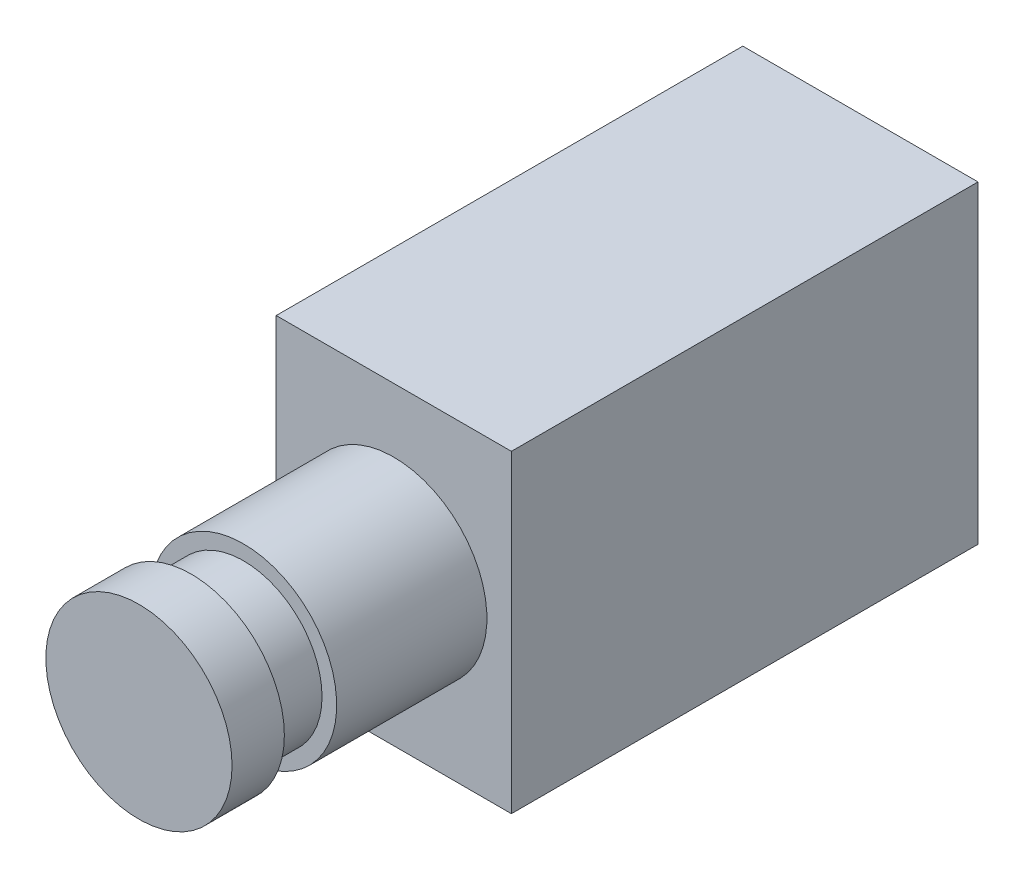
from build123d import *

# Parameters (mm, degrees)
SKETCH1_W           = 14.2748
SKETCH1_H           = 19.05
BOSS_EXTRUDE1_DEPTH = 28.321
SKETCH2_R           = 5.6515
BOSS_EXTRUDE2_DEPTH = 9.1186
SKETCH3_R           = 4.7625
BOSS_EXTRUDE3_DEPTH = 3.175
SKETCH4_R           = 5.6515
BOSS_EXTRUDE4_DEPTH = 3.175


with BuildPart() as part:
    # Sketch1 → Boss-Extrude1 (new body)
    with BuildSketch(Plane.XY):
        Rectangle(SKETCH1_W, SKETCH1_H)
    extrude(amount=BOSS_EXTRUDE1_DEPTH)

    # Sketch2 → Boss-Extrude2 (add)
    with BuildSketch(Plane.XY.offset(28.321)):
        with Locations(Location((0, 0, 0), (0, 0, 180))):
            Circle(SKETCH2_R)
    extrude(amount=BOSS_EXTRUDE2_DEPTH)

    # Sketch3 → Boss-Extrude3 (add)
    with BuildSketch(Plane.XY.offset(37.4396)):
        Circle(SKETCH3_R)
    extrude(amount=BOSS_EXTRUDE3_DEPTH)

    # Sketch4 → Boss-Extrude4 (add)
    with BuildSketch(Plane.XY.offset(40.6146)):
        with Locations(Location((0, 0, 0), (0, 0, 180))):
            Circle(SKETCH4_R)
    extrude(amount=BOSS_EXTRUDE4_DEPTH)


solid = part.part
